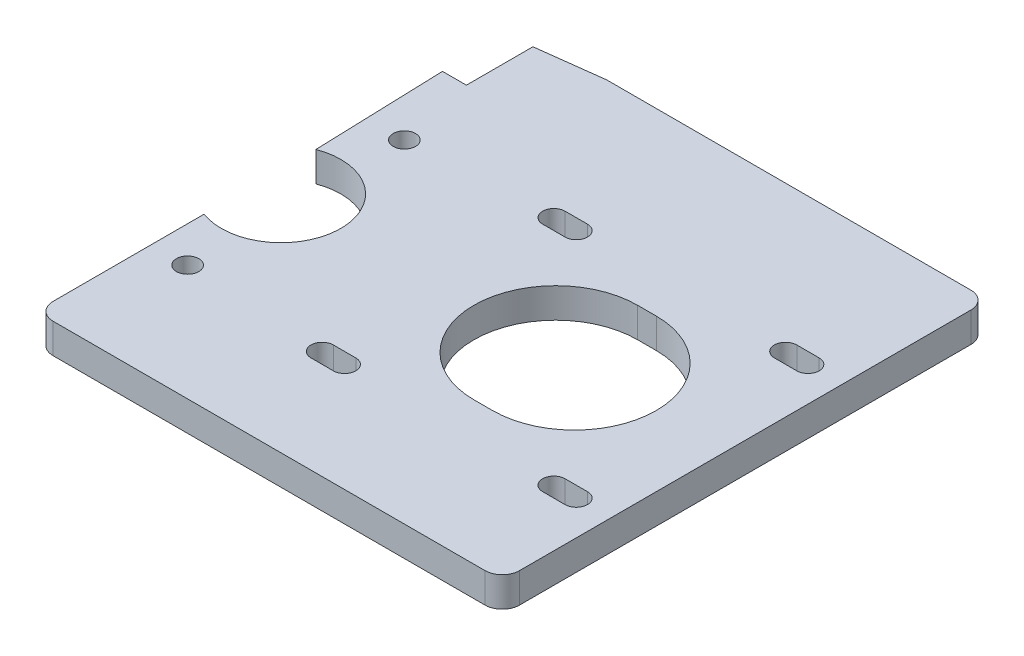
ISO-10303-21;
HEADER;
FILE_DESCRIPTION(('STEP AP214'),'2;1');
FILE_NAME('part.step','',(''),(''),'','','');
FILE_SCHEMA(('AUTOMOTIVE_DESIGN { 1 0 10303 214 1 1 1 1 }'));
ENDSEC;
DATA;
#1=APPLICATION_CONTEXT('core data for automotive mechanical design processes');
#2=APPLICATION_PROTOCOL_DEFINITION('international standard','automotive_design',2000,#1);
#3=PRODUCT_CONTEXT('',#1,'mechanical');
#4=PRODUCT('Part','Part','',(#3));
#5=PRODUCT_RELATED_PRODUCT_CATEGORY('part','',(#4));
#6=PRODUCT_DEFINITION_FORMATION('','',#4);
#7=PRODUCT_DEFINITION_CONTEXT('part definition',#1,'design');
#8=PRODUCT_DEFINITION('design','',#6,#7);
#9=PRODUCT_DEFINITION_SHAPE('','',#8);
#10=(LENGTH_UNIT() NAMED_UNIT(*) SI_UNIT(.MILLI.,.METRE.));
#11=(NAMED_UNIT(*) PLANE_ANGLE_UNIT() SI_UNIT($,.RADIAN.));
#12=(NAMED_UNIT(*) SI_UNIT($,.STERADIAN.) SOLID_ANGLE_UNIT());
#13=UNCERTAINTY_MEASURE_WITH_UNIT(LENGTH_MEASURE(1.E-05),#10,'distance_accuracy_value','');
#14=(GEOMETRIC_REPRESENTATION_CONTEXT(3) GLOBAL_UNCERTAINTY_ASSIGNED_CONTEXT((#13)) GLOBAL_UNIT_ASSIGNED_CONTEXT((#10,
#11,#12)) REPRESENTATION_CONTEXT('',''));
#15=CARTESIAN_POINT('',(0.,0.,0.));
#16=DIRECTION('',(0.,0.,1.));
#17=DIRECTION('',(1.,0.,0.));
#18=AXIS2_PLACEMENT_3D('',#15,#16,#17);
#19=CARTESIAN_POINT('',(0.,-2.,0.));
#20=DIRECTION('',(0.,1.,0.));
#21=DIRECTION('',(0.,0.,1.));
#22=AXIS2_PLACEMENT_3D('',#19,#20,#21);
#23=PLANE('',#22);
#24=CARTESIAN_POINT('',(-26.4,-2.,17.));
#25=DIRECTION('',(0.,1.,0.));
#26=DIRECTION('',(0.,0.,1.));
#27=AXIS2_PLACEMENT_3D('',#24,#25,#26);
#28=CIRCLE('',#27,1.5);
#29=CARTESIAN_POINT('',(-26.4,-2.,18.5));
#30=VERTEX_POINT('',#29);
#31=EDGE_CURVE('E367',#30,#30,#28,.T.);
#32=ORIENTED_EDGE('',*,*,#31,.T.);
#33=EDGE_LOOP('',(#32));
#34=FACE_BOUND('',#33,.T.);
#35=CARTESIAN_POINT('',(-26.4,-2.,-12.));
#36=DIRECTION('',(0.,1.,0.));
#37=DIRECTION('',(0.,0.,1.));
#38=AXIS2_PLACEMENT_3D('',#35,#36,#37);
#39=CIRCLE('',#38,1.5);
#40=CARTESIAN_POINT('',(-26.4,-2.,-10.5));
#41=VERTEX_POINT('',#40);
#42=EDGE_CURVE('E370',#41,#41,#39,.T.);
#43=ORIENTED_EDGE('',*,*,#42,.T.);
#44=EDGE_LOOP('',(#43));
#45=FACE_BOUND('',#44,.T.);
#46=DIRECTION('',(1.,0.,0.));
#47=VECTOR('',#46,1.);
#48=CARTESIAN_POINT('',(-7.4,-2.,-11.5));
#49=LINE('',#48,#47);
#50=CARTESIAN_POINT('',(-7.4,-2.,-11.5));
#51=VERTEX_POINT('',#50);
#52=CARTESIAN_POINT('',(-4.4,-2.,-11.5));
#53=VERTEX_POINT('',#52);
#54=EDGE_CURVE('E238',#51,#53,#49,.T.);
#55=ORIENTED_EDGE('',*,*,#54,.T.);
#56=CARTESIAN_POINT('',(-4.4,-2.,-13.));
#57=DIRECTION('',(0.,1.,0.));
#58=DIRECTION('',(0.,0.,1.));
#59=AXIS2_PLACEMENT_3D('',#56,#57,#58);
#60=CIRCLE('',#59,1.5);
#61=CARTESIAN_POINT('',(-4.4,-2.,-14.5));
#62=VERTEX_POINT('',#61);
#63=EDGE_CURVE('E241',#53,#62,#60,.T.);
#64=ORIENTED_EDGE('',*,*,#63,.T.);
#65=DIRECTION('',(-1.,0.,0.));
#66=VECTOR('',#65,1.);
#67=CARTESIAN_POINT('',(-4.4,-2.,-14.5));
#68=LINE('',#67,#66);
#69=CARTESIAN_POINT('',(-7.4,-2.,-14.5));
#70=VERTEX_POINT('',#69);
#71=EDGE_CURVE('E235',#62,#70,#68,.T.);
#72=ORIENTED_EDGE('',*,*,#71,.T.);
#73=CARTESIAN_POINT('',(-7.4,-2.,-13.));
#74=DIRECTION('',(0.,1.,0.));
#75=DIRECTION('',(0.,0.,1.));
#76=AXIS2_PLACEMENT_3D('',#73,#74,#75);
#77=CIRCLE('',#76,1.5);
#78=EDGE_CURVE('E374',#70,#51,#77,.T.);
#79=ORIENTED_EDGE('',*,*,#78,.T.);
#80=EDGE_LOOP('',(#55,#64,#72,#79));
#81=FACE_BOUND('',#80,.T.);
#82=CARTESIAN_POINT('',(-7.4,-2.,18.));
#83=DIRECTION('',(0.,1.,0.));
#84=DIRECTION('',(0.,0.,1.));
#85=AXIS2_PLACEMENT_3D('',#82,#83,#84);
#86=CIRCLE('',#85,1.5);
#87=CARTESIAN_POINT('',(-7.4,-2.,16.5));
#88=VERTEX_POINT('',#87);
#89=CARTESIAN_POINT('',(-7.4,-2.,19.5));
#90=VERTEX_POINT('',#89);
#91=EDGE_CURVE('E244',#88,#90,#86,.T.);
#92=ORIENTED_EDGE('',*,*,#91,.T.);
#93=DIRECTION('',(1.,0.,0.));
#94=VECTOR('',#93,1.);
#95=CARTESIAN_POINT('',(-7.4,-2.,19.5));
#96=LINE('',#95,#94);
#97=CARTESIAN_POINT('',(-4.4,-2.,19.5));
#98=VERTEX_POINT('',#97);
#99=EDGE_CURVE('E242',#90,#98,#96,.T.);
#100=ORIENTED_EDGE('',*,*,#99,.T.);
#101=CARTESIAN_POINT('',(-4.4,-2.,18.));
#102=DIRECTION('',(0.,1.,0.));
#103=DIRECTION('',(0.,0.,1.));
#104=AXIS2_PLACEMENT_3D('',#101,#102,#103);
#105=CIRCLE('',#104,1.5);
#106=CARTESIAN_POINT('',(-4.4,-2.,16.5));
#107=VERTEX_POINT('',#106);
#108=EDGE_CURVE('E378',#98,#107,#105,.T.);
#109=ORIENTED_EDGE('',*,*,#108,.T.);
#110=DIRECTION('',(-1.,0.,0.));
#111=VECTOR('',#110,1.);
#112=CARTESIAN_POINT('',(-4.4,-2.,16.5));
#113=LINE('',#112,#111);
#114=EDGE_CURVE('E246',#107,#88,#113,.T.);
#115=ORIENTED_EDGE('',*,*,#114,.T.);
#116=EDGE_LOOP('',(#92,#100,#109,#115));
#117=FACE_BOUND('',#116,.T.);
#118=CARTESIAN_POINT('',(23.6,-2.,18.));
#119=DIRECTION('',(0.,1.,0.));
#120=DIRECTION('',(0.,0.,1.));
#121=AXIS2_PLACEMENT_3D('',#118,#119,#120);
#122=CIRCLE('',#121,1.5);
#123=CARTESIAN_POINT('',(23.6,-2.,16.5));
#124=VERTEX_POINT('',#123);
#125=CARTESIAN_POINT('',(23.6,-2.,19.5));
#126=VERTEX_POINT('',#125);
#127=EDGE_CURVE('E252',#124,#126,#122,.T.);
#128=ORIENTED_EDGE('',*,*,#127,.T.);
#129=DIRECTION('',(1.,0.,0.));
#130=VECTOR('',#129,1.);
#131=CARTESIAN_POINT('',(23.6,-2.,19.5));
#132=LINE('',#131,#130);
#133=CARTESIAN_POINT('',(26.6,-2.,19.5));
#134=VERTEX_POINT('',#133);
#135=EDGE_CURVE('E250',#126,#134,#132,.T.);
#136=ORIENTED_EDGE('',*,*,#135,.T.);
#137=CARTESIAN_POINT('',(26.6,-2.,18.));
#138=DIRECTION('',(0.,1.,0.));
#139=DIRECTION('',(0.,0.,1.));
#140=AXIS2_PLACEMENT_3D('',#137,#138,#139);
#141=CIRCLE('',#140,1.5);
#142=CARTESIAN_POINT('',(26.6,-2.,16.5));
#143=VERTEX_POINT('',#142);
#144=EDGE_CURVE('E382',#134,#143,#141,.T.);
#145=ORIENTED_EDGE('',*,*,#144,.T.);
#146=DIRECTION('',(-1.,0.,0.));
#147=VECTOR('',#146,1.);
#148=CARTESIAN_POINT('',(26.6,-2.,16.5));
#149=LINE('',#148,#147);
#150=EDGE_CURVE('E254',#143,#124,#149,.T.);
#151=ORIENTED_EDGE('',*,*,#150,.T.);
#152=EDGE_LOOP('',(#128,#136,#145,#151));
#153=FACE_BOUND('',#152,.T.);
#154=CARTESIAN_POINT('',(23.6,-2.,-13.));
#155=DIRECTION('',(0.,1.,0.));
#156=DIRECTION('',(0.,0.,1.));
#157=AXIS2_PLACEMENT_3D('',#154,#155,#156);
#158=CIRCLE('',#157,1.5);
#159=CARTESIAN_POINT('',(23.6,-2.,-14.5));
#160=VERTEX_POINT('',#159);
#161=CARTESIAN_POINT('',(23.6,-2.,-11.5));
#162=VERTEX_POINT('',#161);
#163=EDGE_CURVE('E260',#160,#162,#158,.T.);
#164=ORIENTED_EDGE('',*,*,#163,.T.);
#165=DIRECTION('',(1.,0.,0.));
#166=VECTOR('',#165,1.);
#167=CARTESIAN_POINT('',(23.6,-2.,-11.5));
#168=LINE('',#167,#166);
#169=CARTESIAN_POINT('',(26.6,-2.,-11.5));
#170=VERTEX_POINT('',#169);
#171=EDGE_CURVE('E258',#162,#170,#168,.T.);
#172=ORIENTED_EDGE('',*,*,#171,.T.);
#173=CARTESIAN_POINT('',(26.6,-2.,-13.));
#174=DIRECTION('',(0.,1.,0.));
#175=DIRECTION('',(0.,0.,1.));
#176=AXIS2_PLACEMENT_3D('',#173,#174,#175);
#177=CIRCLE('',#176,1.5);
#178=CARTESIAN_POINT('',(26.6,-2.,-14.5));
#179=VERTEX_POINT('',#178);
#180=EDGE_CURVE('E386',#170,#179,#177,.T.);
#181=ORIENTED_EDGE('',*,*,#180,.T.);
#182=DIRECTION('',(-1.,0.,0.));
#183=VECTOR('',#182,1.);
#184=CARTESIAN_POINT('',(26.6,-2.,-14.5));
#185=LINE('',#184,#183);
#186=EDGE_CURVE('E262',#179,#160,#185,.T.);
#187=ORIENTED_EDGE('',*,*,#186,.T.);
#188=EDGE_LOOP('',(#164,#172,#181,#187));
#189=FACE_BOUND('',#188,.T.);
#190=CARTESIAN_POINT('',(8.35,-2.,2.5));
#191=DIRECTION('',(0.,1.,0.));
#192=DIRECTION('',(0.,0.,1.));
#193=AXIS2_PLACEMENT_3D('',#190,#191,#192);
#194=CIRCLE('',#193,10.95);
#195=CARTESIAN_POINT('',(8.35,-2.,-8.45));
#196=VERTEX_POINT('',#195);
#197=CARTESIAN_POINT('',(8.35,-2.,13.45));
#198=VERTEX_POINT('',#197);
#199=EDGE_CURVE('E268',#196,#198,#194,.T.);
#200=ORIENTED_EDGE('',*,*,#199,.T.);
#201=DIRECTION('',(1.,0.,0.));
#202=VECTOR('',#201,1.);
#203=CARTESIAN_POINT('',(8.35,-2.,13.45));
#204=LINE('',#203,#202);
#205=CARTESIAN_POINT('',(10.85,-2.,13.45));
#206=VERTEX_POINT('',#205);
#207=EDGE_CURVE('E266',#198,#206,#204,.T.);
#208=ORIENTED_EDGE('',*,*,#207,.T.);
#209=CARTESIAN_POINT('',(10.85,-2.,2.5));
#210=DIRECTION('',(0.,1.,0.));
#211=DIRECTION('',(0.,0.,1.));
#212=AXIS2_PLACEMENT_3D('',#209,#210,#211);
#213=CIRCLE('',#212,10.95);
#214=CARTESIAN_POINT('',(10.85,-2.,-8.45));
#215=VERTEX_POINT('',#214);
#216=EDGE_CURVE('E390',#206,#215,#213,.T.);
#217=ORIENTED_EDGE('',*,*,#216,.T.);
#218=DIRECTION('',(-1.,0.,0.));
#219=VECTOR('',#218,1.);
#220=CARTESIAN_POINT('',(10.85,-2.,-8.45));
#221=LINE('',#220,#219);
#222=EDGE_CURVE('E270',#215,#196,#221,.T.);
#223=ORIENTED_EDGE('',*,*,#222,.T.);
#224=EDGE_LOOP('',(#200,#208,#217,#223));
#225=FACE_BOUND('',#224,.T.);
#226=DIRECTION('',(-1.,0.,0.));
#227=VECTOR('',#226,1.);
#228=CARTESIAN_POINT('',(-28.6,-2.,-22.5));
#229=LINE('',#228,#227);
#230=CARTESIAN_POINT('',(-28.6,-2.,-22.5));
#231=VERTEX_POINT('',#230);
#232=CARTESIAN_POINT('',(-31.8,-2.,-22.5));
#233=VERTEX_POINT('',#232);
#234=EDGE_CURVE('E282',#231,#233,#229,.T.);
#235=ORIENTED_EDGE('',*,*,#234,.F.);
#236=DIRECTION('',(0.,0.,1.));
#237=VECTOR('',#236,1.);
#238=CARTESIAN_POINT('',(-28.6,-2.,-31.4));
#239=LINE('',#238,#237);
#240=CARTESIAN_POINT('',(-28.6,-2.,-31.4));
#241=VERTEX_POINT('',#240);
#242=EDGE_CURVE('E288',#241,#231,#239,.T.);
#243=ORIENTED_EDGE('',*,*,#242,.F.);
#244=DIRECTION('',(-0.992277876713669,0.,0.124034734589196));
#245=VECTOR('',#244,1.);
#246=CARTESIAN_POINT('',(-19.8,-2.,-32.5));
#247=LINE('',#246,#245);
#248=CARTESIAN_POINT('',(-19.8,-2.,-32.5));
#249=VERTEX_POINT('',#248);
#250=EDGE_CURVE('E294',#249,#241,#247,.T.);
#251=ORIENTED_EDGE('',*,*,#250,.F.);
#252=DIRECTION('',(-1.,0.,0.));
#253=VECTOR('',#252,1.);
#254=CARTESIAN_POINT('',(28.9,-2.,-32.5));
#255=LINE('',#254,#253);
#256=CARTESIAN_POINT('',(28.9,-2.,-32.5));
#257=VERTEX_POINT('',#256);
#258=EDGE_CURVE('E300',#257,#249,#255,.T.);
#259=ORIENTED_EDGE('',*,*,#258,.F.);
#260=CARTESIAN_POINT('',(28.9,-2.,-30.2));
#261=DIRECTION('',(0.,1.,0.));
#262=DIRECTION('',(0.,0.,1.));
#263=AXIS2_PLACEMENT_3D('',#260,#261,#262);
#264=CIRCLE('',#263,2.3);
#265=CARTESIAN_POINT('',(31.2,-2.,-30.2));
#266=VERTEX_POINT('',#265);
#267=EDGE_CURVE('E396',#266,#257,#264,.T.);
#268=ORIENTED_EDGE('',*,*,#267,.F.);
#269=DIRECTION('',(0.,0.,-1.));
#270=VECTOR('',#269,1.);
#271=CARTESIAN_POINT('',(31.2,-2.,30.2));
#272=LINE('',#271,#270);
#273=CARTESIAN_POINT('',(31.2,-2.,30.2));
#274=VERTEX_POINT('',#273);
#275=EDGE_CURVE('E306',#274,#266,#272,.T.);
#276=ORIENTED_EDGE('',*,*,#275,.F.);
#277=CARTESIAN_POINT('',(28.9,-2.,30.2));
#278=DIRECTION('',(0.,1.,0.));
#279=DIRECTION('',(0.,0.,1.));
#280=AXIS2_PLACEMENT_3D('',#277,#278,#279);
#281=CIRCLE('',#280,2.3);
#282=CARTESIAN_POINT('',(28.9,-2.,32.5));
#283=VERTEX_POINT('',#282);
#284=EDGE_CURVE('E221',#283,#274,#281,.T.);
#285=ORIENTED_EDGE('',*,*,#284,.F.);
#286=DIRECTION('',(1.,0.,0.));
#287=VECTOR('',#286,1.);
#288=CARTESIAN_POINT('',(-28.9,-2.,32.5));
#289=LINE('',#288,#287);
#290=CARTESIAN_POINT('',(-28.9,-2.,32.5));
#291=VERTEX_POINT('',#290);
#292=EDGE_CURVE('E218',#291,#283,#289,.T.);
#293=ORIENTED_EDGE('',*,*,#292,.F.);
#294=CARTESIAN_POINT('',(-28.9,-2.,30.2));
#295=DIRECTION('',(0.,1.,0.));
#296=DIRECTION('',(0.,0.,1.));
#297=AXIS2_PLACEMENT_3D('',#294,#295,#296);
#298=CIRCLE('',#297,2.3);
#299=CARTESIAN_POINT('',(-31.2,-2.,30.2));
#300=VERTEX_POINT('',#299);
#301=EDGE_CURVE('E20',#300,#291,#298,.T.);
#302=ORIENTED_EDGE('',*,*,#301,.F.);
#303=DIRECTION('',(0.,0.,1.));
#304=VECTOR('',#303,1.);
#305=CARTESIAN_POINT('',(-31.2,-2.,-4.4));
#306=LINE('',#305,#304);
#307=CARTESIAN_POINT('',(-31.2,-2.,9.99399759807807));
#308=VERTEX_POINT('',#307);
#309=EDGE_CURVE('E204',#308,#300,#306,.T.);
#310=ORIENTED_EDGE('',*,*,#309,.F.);
#311=CARTESIAN_POINT('',(-28.4,-2.,2.5));
#312=DIRECTION('',(0.,1.,0.));
#313=DIRECTION('',(0.,0.,1.));
#314=AXIS2_PLACEMENT_3D('',#311,#312,#313);
#315=CIRCLE('',#314,8.);
#316=CARTESIAN_POINT('',(-31.2194486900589,-2.,-4.98670215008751));
#317=VERTEX_POINT('',#316);
#318=EDGE_CURVE('E394',#308,#317,#315,.T.);
#319=ORIENTED_EDGE('',*,*,#318,.T.);
#320=DIRECTION('',(0.0331309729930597,0.,0.999451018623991));
#321=VECTOR('',#320,1.);
#322=CARTESIAN_POINT('',(-31.8,-2.,-22.5));
#323=LINE('',#322,#321);
#324=EDGE_CURVE('E274',#233,#317,#323,.T.);
#325=ORIENTED_EDGE('',*,*,#324,.F.);
#326=EDGE_LOOP('',(#235,#243,#251,#259,#268,#276,#285,#293,#302,#310,#319,#325));
#327=FACE_BOUND('',#326,.T.);
#328=ADVANCED_FACE('F17',(#34,#45,#81,#117,#153,#189,#225,#327),#23,.F.);
#329=CARTESIAN_POINT('',(-31.2,-2.,-4.4));
#330=DIRECTION('',(-1.,0.,0.));
#331=DIRECTION('',(0.,0.,1.));
#332=AXIS2_PLACEMENT_3D('',#329,#330,#331);
#333=PLANE('',#332);
#334=DIRECTION('',(0.,0.,1.));
#335=VECTOR('',#334,1.);
#336=CARTESIAN_POINT('',(-31.2,2.,0.));
#337=LINE('',#336,#335);
#338=CARTESIAN_POINT('',(-31.2,2.,9.99399759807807));
#339=VERTEX_POINT('',#338);
#340=CARTESIAN_POINT('',(-31.2,2.,30.2));
#341=VERTEX_POINT('',#340);
#342=EDGE_CURVE('E366',#339,#341,#337,.T.);
#343=ORIENTED_EDGE('',*,*,#342,.F.);
#344=DIRECTION('',(0.,1.,0.));
#345=VECTOR('',#344,1.);
#346=CARTESIAN_POINT('',(-31.2,2.,9.99399759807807));
#347=LINE('',#346,#345);
#348=EDGE_CURVE('E277',#339,#308,#347,.F.);
#349=ORIENTED_EDGE('',*,*,#348,.T.);
#350=ORIENTED_EDGE('',*,*,#309,.T.);
#351=DIRECTION('',(0.,1.,0.));
#352=VECTOR('',#351,1.);
#353=CARTESIAN_POINT('',(-31.2,-2.,30.2));
#354=LINE('',#353,#352);
#355=EDGE_CURVE('E215',#341,#300,#354,.F.);
#356=ORIENTED_EDGE('',*,*,#355,.F.);
#357=EDGE_LOOP('',(#343,#349,#350,#356));
#358=FACE_BOUND('',#357,.T.);
#359=ADVANCED_FACE('F560',(#358),#333,.T.);
#360=CARTESIAN_POINT('',(-28.9,-2.,30.2));
#361=DIRECTION('',(0.,1.,0.));
#362=DIRECTION('',(0.,0.,1.));
#363=AXIS2_PLACEMENT_3D('',#360,#361,#362);
#364=CYLINDRICAL_SURFACE('',#363,2.3);
#365=ORIENTED_EDGE('',*,*,#355,.T.);
#366=ORIENTED_EDGE('',*,*,#301,.T.);
#367=DIRECTION('',(0.,1.,0.));
#368=VECTOR('',#367,1.);
#369=CARTESIAN_POINT('',(-28.9,-2.,32.5));
#370=LINE('',#369,#368);
#371=CARTESIAN_POINT('',(-28.9,2.,32.5));
#372=VERTEX_POINT('',#371);
#373=EDGE_CURVE('E213',#372,#291,#370,.F.);
#374=ORIENTED_EDGE('',*,*,#373,.F.);
#375=CARTESIAN_POINT('',(-28.9,2.,30.2));
#376=DIRECTION('',(0.,1.,0.));
#377=DIRECTION('',(0.,0.,1.));
#378=AXIS2_PLACEMENT_3D('',#375,#376,#377);
#379=CIRCLE('',#378,2.3);
#380=EDGE_CURVE('E364',#341,#372,#379,.T.);
#381=ORIENTED_EDGE('',*,*,#380,.F.);
#382=EDGE_LOOP('',(#365,#366,#374,#381));
#383=FACE_BOUND('',#382,.T.);
#384=ADVANCED_FACE('F210',(#383),#364,.T.);
#385=CARTESIAN_POINT('',(-28.9,-2.,32.5));
#386=DIRECTION('',(0.,0.,1.));
#387=DIRECTION('',(1.,0.,0.));
#388=AXIS2_PLACEMENT_3D('',#385,#386,#387);
#389=PLANE('',#388);
#390=ORIENTED_EDGE('',*,*,#373,.T.);
#391=ORIENTED_EDGE('',*,*,#292,.T.);
#392=DIRECTION('',(0.,1.,0.));
#393=VECTOR('',#392,1.);
#394=CARTESIAN_POINT('',(28.9,-2.,32.5));
#395=LINE('',#394,#393);
#396=CARTESIAN_POINT('',(28.9,2.,32.5));
#397=VERTEX_POINT('',#396);
#398=EDGE_CURVE('E224',#397,#283,#395,.F.);
#399=ORIENTED_EDGE('',*,*,#398,.F.);
#400=DIRECTION('',(1.,0.,0.));
#401=VECTOR('',#400,1.);
#402=CARTESIAN_POINT('',(0.,2.,32.5));
#403=LINE('',#402,#401);
#404=EDGE_CURVE('E228',#372,#397,#403,.T.);
#405=ORIENTED_EDGE('',*,*,#404,.F.);
#406=EDGE_LOOP('',(#390,#391,#399,#405));
#407=FACE_BOUND('',#406,.T.);
#408=ADVANCED_FACE('F226',(#407),#389,.T.);
#409=CARTESIAN_POINT('',(28.9,-2.,30.2));
#410=DIRECTION('',(0.,1.,0.));
#411=DIRECTION('',(0.,0.,1.));
#412=AXIS2_PLACEMENT_3D('',#409,#410,#411);
#413=CYLINDRICAL_SURFACE('',#412,2.3);
#414=ORIENTED_EDGE('',*,*,#398,.T.);
#415=ORIENTED_EDGE('',*,*,#284,.T.);
#416=DIRECTION('',(0.,1.,0.));
#417=VECTOR('',#416,1.);
#418=CARTESIAN_POINT('',(31.2,-2.,30.2));
#419=LINE('',#418,#417);
#420=CARTESIAN_POINT('',(31.2,2.,30.2));
#421=VERTEX_POINT('',#420);
#422=EDGE_CURVE('E308',#421,#274,#419,.F.);
#423=ORIENTED_EDGE('',*,*,#422,.F.);
#424=CARTESIAN_POINT('',(28.9,2.,30.2));
#425=DIRECTION('',(0.,1.,0.));
#426=DIRECTION('',(0.,0.,1.));
#427=AXIS2_PLACEMENT_3D('',#424,#425,#426);
#428=CIRCLE('',#427,2.3);
#429=EDGE_CURVE('E361',#397,#421,#428,.T.);
#430=ORIENTED_EDGE('',*,*,#429,.F.);
#431=EDGE_LOOP('',(#414,#415,#423,#430));
#432=FACE_BOUND('',#431,.T.);
#433=ADVANCED_FACE('F400',(#432),#413,.T.);
#434=CARTESIAN_POINT('',(31.2,-2.,30.2));
#435=DIRECTION('',(1.,0.,0.));
#436=DIRECTION('',(0.,0.,-1.));
#437=AXIS2_PLACEMENT_3D('',#434,#435,#436);
#438=PLANE('',#437);
#439=ORIENTED_EDGE('',*,*,#422,.T.);
#440=ORIENTED_EDGE('',*,*,#275,.T.);
#441=DIRECTION('',(0.,1.,0.));
#442=VECTOR('',#441,1.);
#443=CARTESIAN_POINT('',(31.2,-2.,-30.2));
#444=LINE('',#443,#442);
#445=CARTESIAN_POINT('',(31.2,2.,-30.2));
#446=VERTEX_POINT('',#445);
#447=EDGE_CURVE('E307',#446,#266,#444,.F.);
#448=ORIENTED_EDGE('',*,*,#447,.F.);
#449=DIRECTION('',(0.,0.,1.));
#450=VECTOR('',#449,1.);
#451=CARTESIAN_POINT('',(31.2,2.,0.));
#452=LINE('',#451,#450);
#453=EDGE_CURVE('E360',#421,#446,#452,.F.);
#454=ORIENTED_EDGE('',*,*,#453,.F.);
#455=EDGE_LOOP('',(#439,#440,#448,#454));
#456=FACE_BOUND('',#455,.T.);
#457=ADVANCED_FACE('F479',(#456),#438,.T.);
#458=CARTESIAN_POINT('',(28.9,-2.,-30.2));
#459=DIRECTION('',(0.,1.,0.));
#460=DIRECTION('',(0.,0.,1.));
#461=AXIS2_PLACEMENT_3D('',#458,#459,#460);
#462=CYLINDRICAL_SURFACE('',#461,2.3);
#463=ORIENTED_EDGE('',*,*,#447,.T.);
#464=ORIENTED_EDGE('',*,*,#267,.T.);
#465=DIRECTION('',(0.,1.,0.));
#466=VECTOR('',#465,1.);
#467=CARTESIAN_POINT('',(28.9,-2.,-32.5));
#468=LINE('',#467,#466);
#469=CARTESIAN_POINT('',(28.9,2.,-32.5));
#470=VERTEX_POINT('',#469);
#471=EDGE_CURVE('E303',#470,#257,#468,.F.);
#472=ORIENTED_EDGE('',*,*,#471,.F.);
#473=CARTESIAN_POINT('',(28.9,2.,-30.2));
#474=DIRECTION('',(0.,1.,0.));
#475=DIRECTION('',(0.,0.,1.));
#476=AXIS2_PLACEMENT_3D('',#473,#474,#475);
#477=CIRCLE('',#476,2.3);
#478=EDGE_CURVE('E356',#446,#470,#477,.T.);
#479=ORIENTED_EDGE('',*,*,#478,.F.);
#480=EDGE_LOOP('',(#463,#464,#472,#479));
#481=FACE_BOUND('',#480,.T.);
#482=ADVANCED_FACE('F475',(#481),#462,.T.);
#483=CARTESIAN_POINT('',(28.9,-2.,-32.5));
#484=DIRECTION('',(0.,0.,-1.));
#485=DIRECTION('',(-1.,0.,0.));
#486=AXIS2_PLACEMENT_3D('',#483,#484,#485);
#487=PLANE('',#486);
#488=ORIENTED_EDGE('',*,*,#471,.T.);
#489=ORIENTED_EDGE('',*,*,#258,.T.);
#490=DIRECTION('',(0.,1.,0.));
#491=VECTOR('',#490,1.);
#492=CARTESIAN_POINT('',(-19.8,-2.,-32.5));
#493=LINE('',#492,#491);
#494=CARTESIAN_POINT('',(-19.8,2.,-32.5));
#495=VERTEX_POINT('',#494);
#496=EDGE_CURVE('E297',#495,#249,#493,.F.);
#497=ORIENTED_EDGE('',*,*,#496,.F.);
#498=DIRECTION('',(1.,0.,0.));
#499=VECTOR('',#498,1.);
#500=CARTESIAN_POINT('',(0.,2.,-32.5));
#501=LINE('',#500,#499);
#502=EDGE_CURVE('E359',#470,#495,#501,.F.);
#503=ORIENTED_EDGE('',*,*,#502,.F.);
#504=EDGE_LOOP('',(#488,#489,#497,#503));
#505=FACE_BOUND('',#504,.T.);
#506=ADVANCED_FACE('F485',(#505),#487,.T.);
#507=CARTESIAN_POINT('',(-19.8,-2.,-32.5));
#508=DIRECTION('',(-0.124034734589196,0.,-0.992277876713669));
#509=DIRECTION('',(-0.992277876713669,0.,0.124034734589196));
#510=AXIS2_PLACEMENT_3D('',#507,#508,#509);
#511=PLANE('',#510);
#512=ORIENTED_EDGE('',*,*,#496,.T.);
#513=ORIENTED_EDGE('',*,*,#250,.T.);
#514=DIRECTION('',(0.,1.,0.));
#515=VECTOR('',#514,1.);
#516=CARTESIAN_POINT('',(-28.6,-2.,-31.4));
#517=LINE('',#516,#515);
#518=CARTESIAN_POINT('',(-28.6,2.,-31.4));
#519=VERTEX_POINT('',#518);
#520=EDGE_CURVE('E291',#519,#241,#517,.F.);
#521=ORIENTED_EDGE('',*,*,#520,.F.);
#522=DIRECTION('',(-0.992277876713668,0.,0.124034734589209));
#523=VECTOR('',#522,1.);
#524=CARTESIAN_POINT('',(-19.8,2.,-32.5));
#525=LINE('',#524,#523);
#526=EDGE_CURVE('E455',#495,#519,#525,.T.);
#527=ORIENTED_EDGE('',*,*,#526,.F.);
#528=EDGE_LOOP('',(#512,#513,#521,#527));
#529=FACE_BOUND('',#528,.T.);
#530=ADVANCED_FACE('F620',(#529),#511,.T.);
#531=CARTESIAN_POINT('',(-28.6,-2.,-31.4));
#532=DIRECTION('',(-1.,0.,0.));
#533=DIRECTION('',(0.,0.,1.));
#534=AXIS2_PLACEMENT_3D('',#531,#532,#533);
#535=PLANE('',#534);
#536=ORIENTED_EDGE('',*,*,#520,.T.);
#537=ORIENTED_EDGE('',*,*,#242,.T.);
#538=DIRECTION('',(0.,1.,0.));
#539=VECTOR('',#538,1.);
#540=CARTESIAN_POINT('',(-28.6,-2.,-22.5));
#541=LINE('',#540,#539);
#542=CARTESIAN_POINT('',(-28.6,2.,-22.5));
#543=VERTEX_POINT('',#542);
#544=EDGE_CURVE('E285',#543,#231,#541,.F.);
#545=ORIENTED_EDGE('',*,*,#544,.F.);
#546=DIRECTION('',(0.,0.,1.));
#547=VECTOR('',#546,1.);
#548=CARTESIAN_POINT('',(-28.6,2.,0.));
#549=LINE('',#548,#547);
#550=EDGE_CURVE('E446',#519,#543,#549,.T.);
#551=ORIENTED_EDGE('',*,*,#550,.F.);
#552=EDGE_LOOP('',(#536,#537,#545,#551));
#553=FACE_BOUND('',#552,.T.);
#554=ADVANCED_FACE('F616',(#553),#535,.T.);
#555=CARTESIAN_POINT('',(-28.6,-2.,-22.5));
#556=DIRECTION('',(0.,0.,-1.));
#557=DIRECTION('',(-1.,0.,0.));
#558=AXIS2_PLACEMENT_3D('',#555,#556,#557);
#559=PLANE('',#558);
#560=ORIENTED_EDGE('',*,*,#544,.T.);
#561=ORIENTED_EDGE('',*,*,#234,.T.);
#562=DIRECTION('',(0.,1.,0.));
#563=VECTOR('',#562,1.);
#564=CARTESIAN_POINT('',(-31.8,-2.,-22.5));
#565=LINE('',#564,#563);
#566=CARTESIAN_POINT('',(-31.8,2.,-22.5));
#567=VERTEX_POINT('',#566);
#568=EDGE_CURVE('E278',#567,#233,#565,.F.);
#569=ORIENTED_EDGE('',*,*,#568,.F.);
#570=DIRECTION('',(1.,0.,0.));
#571=VECTOR('',#570,1.);
#572=CARTESIAN_POINT('',(0.,2.,-22.5));
#573=LINE('',#572,#571);
#574=EDGE_CURVE('E443',#543,#567,#573,.F.);
#575=ORIENTED_EDGE('',*,*,#574,.F.);
#576=EDGE_LOOP('',(#560,#561,#569,#575));
#577=FACE_BOUND('',#576,.T.);
#578=ADVANCED_FACE('F612',(#577),#559,.T.);
#579=CARTESIAN_POINT('',(-31.8,-2.,-22.5));
#580=DIRECTION('',(-0.999451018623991,0.,0.0331309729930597));
#581=DIRECTION('',(0.0331309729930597,0.,0.999451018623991));
#582=AXIS2_PLACEMENT_3D('',#579,#580,#581);
#583=PLANE('',#582);
#584=ORIENTED_EDGE('',*,*,#568,.T.);
#585=ORIENTED_EDGE('',*,*,#324,.T.);
#586=DIRECTION('',(0.,1.,0.));
#587=VECTOR('',#586,1.);
#588=CARTESIAN_POINT('',(-31.2194486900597,2.,-4.98670215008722));
#589=LINE('',#588,#587);
#590=CARTESIAN_POINT('',(-31.2194486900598,2.,-4.98670215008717));
#591=VERTEX_POINT('',#590);
#592=EDGE_CURVE('E269',#317,#591,#589,.T.);
#593=ORIENTED_EDGE('',*,*,#592,.T.);
#594=DIRECTION('',(0.0331309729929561,0.,0.999451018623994));
#595=VECTOR('',#594,1.);
#596=CARTESIAN_POINT('',(-31.8,2.,-22.5));
#597=LINE('',#596,#595);
#598=EDGE_CURVE('E355',#567,#591,#597,.T.);
#599=ORIENTED_EDGE('',*,*,#598,.F.);
#600=EDGE_LOOP('',(#584,#585,#593,#599));
#601=FACE_BOUND('',#600,.T.);
#602=ADVANCED_FACE('F608',(#601),#583,.T.);
#603=CARTESIAN_POINT('',(-28.4,2.,2.5));
#604=DIRECTION('',(0.,1.,0.));
#605=DIRECTION('',(0.,0.,1.));
#606=AXIS2_PLACEMENT_3D('',#603,#604,#605);
#607=CYLINDRICAL_SURFACE('',#606,8.);
#608=ORIENTED_EDGE('',*,*,#318,.F.);
#609=ORIENTED_EDGE('',*,*,#348,.F.);
#610=CARTESIAN_POINT('',(-28.4,2.,2.5));
#611=DIRECTION('',(0.,1.,0.));
#612=DIRECTION('',(0.,0.,1.));
#613=AXIS2_PLACEMENT_3D('',#610,#611,#612);
#614=CIRCLE('',#613,8.);
#615=EDGE_CURVE('E352',#591,#339,#614,.F.);
#616=ORIENTED_EDGE('',*,*,#615,.F.);
#617=ORIENTED_EDGE('',*,*,#592,.F.);
#618=EDGE_LOOP('',(#608,#609,#616,#617));
#619=FACE_BOUND('',#618,.T.);
#620=ADVANCED_FACE('F605',(#619),#607,.F.);
#621=CARTESIAN_POINT('',(8.35,2.,13.45));
#622=DIRECTION('',(0.,0.,1.));
#623=DIRECTION('',(1.,0.,0.));
#624=AXIS2_PLACEMENT_3D('',#621,#622,#623);
#625=PLANE('',#624);
#626=DIRECTION('',(1.,0.,0.));
#627=VECTOR('',#626,1.);
#628=CARTESIAN_POINT('',(0.,2.,13.45));
#629=LINE('',#628,#627);
#630=CARTESIAN_POINT('',(10.85,2.,13.45));
#631=VERTEX_POINT('',#630);
#632=CARTESIAN_POINT('',(8.35,2.,13.45));
#633=VERTEX_POINT('',#632);
#634=EDGE_CURVE('E351',#631,#633,#629,.F.);
#635=ORIENTED_EDGE('',*,*,#634,.F.);
#636=DIRECTION('',(0.,1.,0.));
#637=VECTOR('',#636,1.);
#638=CARTESIAN_POINT('',(10.85,2.,13.45));
#639=LINE('',#638,#637);
#640=EDGE_CURVE('E261',#631,#206,#639,.F.);
#641=ORIENTED_EDGE('',*,*,#640,.T.);
#642=ORIENTED_EDGE('',*,*,#207,.F.);
#643=DIRECTION('',(0.,1.,0.));
#644=VECTOR('',#643,1.);
#645=CARTESIAN_POINT('',(8.35,2.,13.45));
#646=LINE('',#645,#644);
#647=EDGE_CURVE('E273',#198,#633,#646,.T.);
#648=ORIENTED_EDGE('',*,*,#647,.T.);
#649=EDGE_LOOP('',(#635,#641,#642,#648));
#650=FACE_BOUND('',#649,.T.);
#651=ADVANCED_FACE('F579',(#650),#625,.F.);
#652=CARTESIAN_POINT('',(8.35,2.,2.5));
#653=DIRECTION('',(0.,1.,0.));
#654=DIRECTION('',(0.,0.,1.));
#655=AXIS2_PLACEMENT_3D('',#652,#653,#654);
#656=CYLINDRICAL_SURFACE('',#655,10.95);
#657=CARTESIAN_POINT('',(8.35,2.,2.5));
#658=DIRECTION('',(0.,1.,0.));
#659=DIRECTION('',(0.,0.,1.));
#660=AXIS2_PLACEMENT_3D('',#657,#658,#659);
#661=CIRCLE('',#660,10.95);
#662=CARTESIAN_POINT('',(8.35,2.,-8.45));
#663=VERTEX_POINT('',#662);
#664=EDGE_CURVE('E348',#633,#663,#661,.F.);
#665=ORIENTED_EDGE('',*,*,#664,.F.);
#666=ORIENTED_EDGE('',*,*,#647,.F.);
#667=ORIENTED_EDGE('',*,*,#199,.F.);
#668=DIRECTION('',(0.,1.,0.));
#669=VECTOR('',#668,1.);
#670=CARTESIAN_POINT('',(8.35,2.,-8.45));
#671=LINE('',#670,#669);
#672=EDGE_CURVE('E272',#196,#663,#671,.T.);
#673=ORIENTED_EDGE('',*,*,#672,.T.);
#674=EDGE_LOOP('',(#665,#666,#667,#673));
#675=FACE_BOUND('',#674,.T.);
#676=ADVANCED_FACE('F583',(#675),#656,.F.);
#677=CARTESIAN_POINT('',(10.85,2.,-8.45));
#678=DIRECTION('',(0.,0.,-1.));
#679=DIRECTION('',(-1.,0.,0.));
#680=AXIS2_PLACEMENT_3D('',#677,#678,#679);
#681=PLANE('',#680);
#682=DIRECTION('',(1.,0.,0.));
#683=VECTOR('',#682,1.);
#684=CARTESIAN_POINT('',(0.,2.,-8.45));
#685=LINE('',#684,#683);
#686=CARTESIAN_POINT('',(10.85,2.,-8.45));
#687=VERTEX_POINT('',#686);
#688=EDGE_CURVE('E347',#663,#687,#685,.T.);
#689=ORIENTED_EDGE('',*,*,#688,.F.);
#690=ORIENTED_EDGE('',*,*,#672,.F.);
#691=ORIENTED_EDGE('',*,*,#222,.F.);
#692=DIRECTION('',(0.,1.,0.));
#693=VECTOR('',#692,1.);
#694=CARTESIAN_POINT('',(10.85,2.,-8.45));
#695=LINE('',#694,#693);
#696=EDGE_CURVE('E392',#215,#687,#695,.T.);
#697=ORIENTED_EDGE('',*,*,#696,.T.);
#698=EDGE_LOOP('',(#689,#690,#691,#697));
#699=FACE_BOUND('',#698,.T.);
#700=ADVANCED_FACE('F591',(#699),#681,.F.);
#701=CARTESIAN_POINT('',(10.85,2.,2.5));
#702=DIRECTION('',(0.,1.,0.));
#703=DIRECTION('',(0.,0.,1.));
#704=AXIS2_PLACEMENT_3D('',#701,#702,#703);
#705=CYLINDRICAL_SURFACE('',#704,10.95);
#706=CARTESIAN_POINT('',(10.85,2.,2.5));
#707=DIRECTION('',(0.,1.,0.));
#708=DIRECTION('',(0.,0.,1.));
#709=AXIS2_PLACEMENT_3D('',#706,#707,#708);
#710=CIRCLE('',#709,10.95);
#711=EDGE_CURVE('E344',#687,#631,#710,.F.);
#712=ORIENTED_EDGE('',*,*,#711,.F.);
#713=ORIENTED_EDGE('',*,*,#696,.F.);
#714=ORIENTED_EDGE('',*,*,#216,.F.);
#715=ORIENTED_EDGE('',*,*,#640,.F.);
#716=EDGE_LOOP('',(#712,#713,#714,#715));
#717=FACE_BOUND('',#716,.T.);
#718=ADVANCED_FACE('F588',(#717),#705,.F.);
#719=CARTESIAN_POINT('',(23.6,2.,-11.5));
#720=DIRECTION('',(0.,0.,1.));
#721=DIRECTION('',(1.,0.,0.));
#722=AXIS2_PLACEMENT_3D('',#719,#720,#721);
#723=PLANE('',#722);
#724=DIRECTION('',(1.,0.,0.));
#725=VECTOR('',#724,1.);
#726=CARTESIAN_POINT('',(0.,2.,-11.5));
#727=LINE('',#726,#725);
#728=CARTESIAN_POINT('',(26.6,2.,-11.5));
#729=VERTEX_POINT('',#728);
#730=CARTESIAN_POINT('',(23.6,2.,-11.5));
#731=VERTEX_POINT('',#730);
#732=EDGE_CURVE('E343',#729,#731,#727,.F.);
#733=ORIENTED_EDGE('',*,*,#732,.F.);
#734=DIRECTION('',(0.,1.,0.));
#735=VECTOR('',#734,1.);
#736=CARTESIAN_POINT('',(26.6,2.,-11.5));
#737=LINE('',#736,#735);
#738=EDGE_CURVE('E253',#729,#170,#737,.F.);
#739=ORIENTED_EDGE('',*,*,#738,.T.);
#740=ORIENTED_EDGE('',*,*,#171,.F.);
#741=DIRECTION('',(0.,1.,0.));
#742=VECTOR('',#741,1.);
#743=CARTESIAN_POINT('',(23.6,2.,-11.5));
#744=LINE('',#743,#742);
#745=EDGE_CURVE('E265',#162,#731,#744,.T.);
#746=ORIENTED_EDGE('',*,*,#745,.T.);
#747=EDGE_LOOP('',(#733,#739,#740,#746));
#748=FACE_BOUND('',#747,.T.);
#749=ADVANCED_FACE('F598',(#748),#723,.F.);
#750=CARTESIAN_POINT('',(23.6,2.,-13.));
#751=DIRECTION('',(0.,1.,0.));
#752=DIRECTION('',(0.,0.,1.));
#753=AXIS2_PLACEMENT_3D('',#750,#751,#752);
#754=CYLINDRICAL_SURFACE('',#753,1.5);
#755=CARTESIAN_POINT('',(23.6,2.,-13.));
#756=DIRECTION('',(0.,1.,0.));
#757=DIRECTION('',(0.,0.,1.));
#758=AXIS2_PLACEMENT_3D('',#755,#756,#757);
#759=CIRCLE('',#758,1.5);
#760=CARTESIAN_POINT('',(23.6,2.,-14.5));
#761=VERTEX_POINT('',#760);
#762=EDGE_CURVE('E340',#731,#761,#759,.F.);
#763=ORIENTED_EDGE('',*,*,#762,.F.);
#764=ORIENTED_EDGE('',*,*,#745,.F.);
#765=ORIENTED_EDGE('',*,*,#163,.F.);
#766=DIRECTION('',(0.,1.,0.));
#767=VECTOR('',#766,1.);
#768=CARTESIAN_POINT('',(23.6,2.,-14.5));
#769=LINE('',#768,#767);
#770=EDGE_CURVE('E264',#160,#761,#769,.T.);
#771=ORIENTED_EDGE('',*,*,#770,.T.);
#772=EDGE_LOOP('',(#763,#764,#765,#771));
#773=FACE_BOUND('',#772,.T.);
#774=ADVANCED_FACE('F733',(#773),#754,.F.);
#775=CARTESIAN_POINT('',(26.6,2.,-14.5));
#776=DIRECTION('',(0.,0.,-1.));
#777=DIRECTION('',(-1.,0.,0.));
#778=AXIS2_PLACEMENT_3D('',#775,#776,#777);
#779=PLANE('',#778);
#780=DIRECTION('',(1.,0.,0.));
#781=VECTOR('',#780,1.);
#782=CARTESIAN_POINT('',(0.,2.,-14.5));
#783=LINE('',#782,#781);
#784=CARTESIAN_POINT('',(26.6,2.,-14.5));
#785=VERTEX_POINT('',#784);
#786=EDGE_CURVE('E339',#761,#785,#783,.T.);
#787=ORIENTED_EDGE('',*,*,#786,.F.);
#788=ORIENTED_EDGE('',*,*,#770,.F.);
#789=ORIENTED_EDGE('',*,*,#186,.F.);
#790=DIRECTION('',(0.,1.,0.));
#791=VECTOR('',#790,1.);
#792=CARTESIAN_POINT('',(26.6,2.,-14.5));
#793=LINE('',#792,#791);
#794=EDGE_CURVE('E388',#179,#785,#793,.T.);
#795=ORIENTED_EDGE('',*,*,#794,.T.);
#796=EDGE_LOOP('',(#787,#788,#789,#795));
#797=FACE_BOUND('',#796,.T.);
#798=ADVANCED_FACE('F740',(#797),#779,.F.);
#799=CARTESIAN_POINT('',(26.6,2.,-13.));
#800=DIRECTION('',(0.,1.,0.));
#801=DIRECTION('',(0.,0.,1.));
#802=AXIS2_PLACEMENT_3D('',#799,#800,#801);
#803=CYLINDRICAL_SURFACE('',#802,1.5);
#804=CARTESIAN_POINT('',(26.6,2.,-13.));
#805=DIRECTION('',(0.,1.,0.));
#806=DIRECTION('',(0.,0.,1.));
#807=AXIS2_PLACEMENT_3D('',#804,#805,#806);
#808=CIRCLE('',#807,1.5);
#809=EDGE_CURVE('E336',#785,#729,#808,.F.);
#810=ORIENTED_EDGE('',*,*,#809,.F.);
#811=ORIENTED_EDGE('',*,*,#794,.F.);
#812=ORIENTED_EDGE('',*,*,#180,.F.);
#813=ORIENTED_EDGE('',*,*,#738,.F.);
#814=EDGE_LOOP('',(#810,#811,#812,#813));
#815=FACE_BOUND('',#814,.T.);
#816=ADVANCED_FACE('F748',(#815),#803,.F.);
#817=CARTESIAN_POINT('',(23.6,2.,19.5));
#818=DIRECTION('',(0.,0.,1.));
#819=DIRECTION('',(1.,0.,0.));
#820=AXIS2_PLACEMENT_3D('',#817,#818,#819);
#821=PLANE('',#820);
#822=DIRECTION('',(1.,0.,0.));
#823=VECTOR('',#822,1.);
#824=CARTESIAN_POINT('',(0.,2.,19.5));
#825=LINE('',#824,#823);
#826=CARTESIAN_POINT('',(26.6,2.,19.5));
#827=VERTEX_POINT('',#826);
#828=CARTESIAN_POINT('',(23.6,2.,19.5));
#829=VERTEX_POINT('',#828);
#830=EDGE_CURVE('E335',#827,#829,#825,.F.);
#831=ORIENTED_EDGE('',*,*,#830,.F.);
#832=DIRECTION('',(0.,1.,0.));
#833=VECTOR('',#832,1.);
#834=CARTESIAN_POINT('',(26.6,2.,19.5));
#835=LINE('',#834,#833);
#836=EDGE_CURVE('E245',#827,#134,#835,.F.);
#837=ORIENTED_EDGE('',*,*,#836,.T.);
#838=ORIENTED_EDGE('',*,*,#135,.F.);
#839=DIRECTION('',(0.,1.,0.));
#840=VECTOR('',#839,1.);
#841=CARTESIAN_POINT('',(23.6,2.,19.5));
#842=LINE('',#841,#840);
#843=EDGE_CURVE('E257',#126,#829,#842,.T.);
#844=ORIENTED_EDGE('',*,*,#843,.T.);
#845=EDGE_LOOP('',(#831,#837,#838,#844));
#846=FACE_BOUND('',#845,.T.);
#847=ADVANCED_FACE('F756',(#846),#821,.F.);
#848=CARTESIAN_POINT('',(23.6,2.,18.));
#849=DIRECTION('',(0.,1.,0.));
#850=DIRECTION('',(0.,0.,1.));
#851=AXIS2_PLACEMENT_3D('',#848,#849,#850);
#852=CYLINDRICAL_SURFACE('',#851,1.5);
#853=CARTESIAN_POINT('',(23.6,2.,18.));
#854=DIRECTION('',(0.,1.,0.));
#855=DIRECTION('',(0.,0.,1.));
#856=AXIS2_PLACEMENT_3D('',#853,#854,#855);
#857=CIRCLE('',#856,1.5);
#858=CARTESIAN_POINT('',(23.6,2.,16.5));
#859=VERTEX_POINT('',#858);
#860=EDGE_CURVE('E332',#829,#859,#857,.F.);
#861=ORIENTED_EDGE('',*,*,#860,.F.);
#862=ORIENTED_EDGE('',*,*,#843,.F.);
#863=ORIENTED_EDGE('',*,*,#127,.F.);
#864=DIRECTION('',(0.,1.,0.));
#865=VECTOR('',#864,1.);
#866=CARTESIAN_POINT('',(23.6,2.,16.5));
#867=LINE('',#866,#865);
#868=EDGE_CURVE('E256',#124,#859,#867,.T.);
#869=ORIENTED_EDGE('',*,*,#868,.T.);
#870=EDGE_LOOP('',(#861,#862,#863,#869));
#871=FACE_BOUND('',#870,.T.);
#872=ADVANCED_FACE('F764',(#871),#852,.F.);
#873=CARTESIAN_POINT('',(26.6,2.,16.5));
#874=DIRECTION('',(0.,0.,-1.));
#875=DIRECTION('',(-1.,0.,0.));
#876=AXIS2_PLACEMENT_3D('',#873,#874,#875);
#877=PLANE('',#876);
#878=DIRECTION('',(1.,0.,0.));
#879=VECTOR('',#878,1.);
#880=CARTESIAN_POINT('',(0.,2.,16.5));
#881=LINE('',#880,#879);
#882=CARTESIAN_POINT('',(26.6,2.,16.5));
#883=VERTEX_POINT('',#882);
#884=EDGE_CURVE('E331',#859,#883,#881,.T.);
#885=ORIENTED_EDGE('',*,*,#884,.F.);
#886=ORIENTED_EDGE('',*,*,#868,.F.);
#887=ORIENTED_EDGE('',*,*,#150,.F.);
#888=DIRECTION('',(0.,1.,0.));
#889=VECTOR('',#888,1.);
#890=CARTESIAN_POINT('',(26.6,2.,16.5));
#891=LINE('',#890,#889);
#892=EDGE_CURVE('E384',#143,#883,#891,.T.);
#893=ORIENTED_EDGE('',*,*,#892,.T.);
#894=EDGE_LOOP('',(#885,#886,#887,#893));
#895=FACE_BOUND('',#894,.T.);
#896=ADVANCED_FACE('F772',(#895),#877,.F.);
#897=CARTESIAN_POINT('',(26.6,2.,18.));
#898=DIRECTION('',(0.,1.,0.));
#899=DIRECTION('',(0.,0.,1.));
#900=AXIS2_PLACEMENT_3D('',#897,#898,#899);
#901=CYLINDRICAL_SURFACE('',#900,1.5);
#902=CARTESIAN_POINT('',(26.6,2.,18.));
#903=DIRECTION('',(0.,1.,0.));
#904=DIRECTION('',(0.,0.,1.));
#905=AXIS2_PLACEMENT_3D('',#902,#903,#904);
#906=CIRCLE('',#905,1.5);
#907=EDGE_CURVE('E328',#883,#827,#906,.F.);
#908=ORIENTED_EDGE('',*,*,#907,.F.);
#909=ORIENTED_EDGE('',*,*,#892,.F.);
#910=ORIENTED_EDGE('',*,*,#144,.F.);
#911=ORIENTED_EDGE('',*,*,#836,.F.);
#912=EDGE_LOOP('',(#908,#909,#910,#911));
#913=FACE_BOUND('',#912,.T.);
#914=ADVANCED_FACE('F780',(#913),#901,.F.);
#915=CARTESIAN_POINT('',(-7.4,2.,19.5));
#916=DIRECTION('',(0.,0.,1.));
#917=DIRECTION('',(1.,0.,0.));
#918=AXIS2_PLACEMENT_3D('',#915,#916,#917);
#919=PLANE('',#918);
#920=DIRECTION('',(1.,0.,0.));
#921=VECTOR('',#920,1.);
#922=CARTESIAN_POINT('',(0.,2.,19.5));
#923=LINE('',#922,#921);
#924=CARTESIAN_POINT('',(-4.4,2.,19.5));
#925=VERTEX_POINT('',#924);
#926=CARTESIAN_POINT('',(-7.4,2.,19.5));
#927=VERTEX_POINT('',#926);
#928=EDGE_CURVE('E327',#925,#927,#923,.F.);
#929=ORIENTED_EDGE('',*,*,#928,.F.);
#930=DIRECTION('',(0.,1.,0.));
#931=VECTOR('',#930,1.);
#932=CARTESIAN_POINT('',(-4.4,2.,19.5));
#933=LINE('',#932,#931);
#934=EDGE_CURVE('E377',#925,#98,#933,.F.);
#935=ORIENTED_EDGE('',*,*,#934,.T.);
#936=ORIENTED_EDGE('',*,*,#99,.F.);
#937=DIRECTION('',(0.,1.,0.));
#938=VECTOR('',#937,1.);
#939=CARTESIAN_POINT('',(-7.4,2.,19.5));
#940=LINE('',#939,#938);
#941=EDGE_CURVE('E249',#90,#927,#940,.T.);
#942=ORIENTED_EDGE('',*,*,#941,.T.);
#943=EDGE_LOOP('',(#929,#935,#936,#942));
#944=FACE_BOUND('',#943,.T.);
#945=ADVANCED_FACE('F788',(#944),#919,.F.);
#946=CARTESIAN_POINT('',(-7.4,2.,18.));
#947=DIRECTION('',(0.,1.,0.));
#948=DIRECTION('',(0.,0.,1.));
#949=AXIS2_PLACEMENT_3D('',#946,#947,#948);
#950=CYLINDRICAL_SURFACE('',#949,1.5);
#951=CARTESIAN_POINT('',(-7.4,2.,18.));
#952=DIRECTION('',(0.,1.,0.));
#953=DIRECTION('',(0.,0.,1.));
#954=AXIS2_PLACEMENT_3D('',#951,#952,#953);
#955=CIRCLE('',#954,1.5);
#956=CARTESIAN_POINT('',(-7.4,2.,16.5));
#957=VERTEX_POINT('',#956);
#958=EDGE_CURVE('E324',#927,#957,#955,.F.);
#959=ORIENTED_EDGE('',*,*,#958,.F.);
#960=ORIENTED_EDGE('',*,*,#941,.F.);
#961=ORIENTED_EDGE('',*,*,#91,.F.);
#962=DIRECTION('',(0.,1.,0.));
#963=VECTOR('',#962,1.);
#964=CARTESIAN_POINT('',(-7.4,2.,16.5));
#965=LINE('',#964,#963);
#966=EDGE_CURVE('E248',#88,#957,#965,.T.);
#967=ORIENTED_EDGE('',*,*,#966,.T.);
#968=EDGE_LOOP('',(#959,#960,#961,#967));
#969=FACE_BOUND('',#968,.T.);
#970=ADVANCED_FACE('F796',(#969),#950,.F.);
#971=CARTESIAN_POINT('',(-4.4,2.,16.5));
#972=DIRECTION('',(0.,0.,-1.));
#973=DIRECTION('',(-1.,0.,0.));
#974=AXIS2_PLACEMENT_3D('',#971,#972,#973);
#975=PLANE('',#974);
#976=DIRECTION('',(1.,0.,0.));
#977=VECTOR('',#976,1.);
#978=CARTESIAN_POINT('',(0.,2.,16.5));
#979=LINE('',#978,#977);
#980=CARTESIAN_POINT('',(-4.4,2.,16.5));
#981=VERTEX_POINT('',#980);
#982=EDGE_CURVE('E323',#957,#981,#979,.T.);
#983=ORIENTED_EDGE('',*,*,#982,.F.);
#984=ORIENTED_EDGE('',*,*,#966,.F.);
#985=ORIENTED_EDGE('',*,*,#114,.F.);
#986=DIRECTION('',(0.,1.,0.));
#987=VECTOR('',#986,1.);
#988=CARTESIAN_POINT('',(-4.4,2.,16.5));
#989=LINE('',#988,#987);
#990=EDGE_CURVE('E380',#107,#981,#989,.T.);
#991=ORIENTED_EDGE('',*,*,#990,.T.);
#992=EDGE_LOOP('',(#983,#984,#985,#991));
#993=FACE_BOUND('',#992,.T.);
#994=ADVANCED_FACE('F804',(#993),#975,.F.);
#995=CARTESIAN_POINT('',(-4.4,2.,18.));
#996=DIRECTION('',(0.,1.,0.));
#997=DIRECTION('',(0.,0.,1.));
#998=AXIS2_PLACEMENT_3D('',#995,#996,#997);
#999=CYLINDRICAL_SURFACE('',#998,1.5);
#1000=CARTESIAN_POINT('',(-4.4,2.,18.));
#1001=DIRECTION('',(0.,1.,0.));
#1002=DIRECTION('',(0.,0.,1.));
#1003=AXIS2_PLACEMENT_3D('',#1000,#1001,#1002);
#1004=CIRCLE('',#1003,1.5);
#1005=EDGE_CURVE('E320',#981,#925,#1004,.F.);
#1006=ORIENTED_EDGE('',*,*,#1005,.F.);
#1007=ORIENTED_EDGE('',*,*,#990,.F.);
#1008=ORIENTED_EDGE('',*,*,#108,.F.);
#1009=ORIENTED_EDGE('',*,*,#934,.F.);
#1010=EDGE_LOOP('',(#1006,#1007,#1008,#1009));
#1011=FACE_BOUND('',#1010,.T.);
#1012=ADVANCED_FACE('F812',(#1011),#999,.F.);
#1013=CARTESIAN_POINT('',(-4.4,2.,-13.));
#1014=DIRECTION('',(0.,1.,0.));
#1015=DIRECTION('',(0.,0.,1.));
#1016=AXIS2_PLACEMENT_3D('',#1013,#1014,#1015);
#1017=CYLINDRICAL_SURFACE('',#1016,1.5);
#1018=CARTESIAN_POINT('',(-4.4,2.,-13.));
#1019=DIRECTION('',(0.,1.,0.));
#1020=DIRECTION('',(0.,0.,1.));
#1021=AXIS2_PLACEMENT_3D('',#1018,#1019,#1020);
#1022=CIRCLE('',#1021,1.5);
#1023=CARTESIAN_POINT('',(-4.4,2.,-14.5));
#1024=VERTEX_POINT('',#1023);
#1025=CARTESIAN_POINT('',(-4.4,2.,-11.5));
#1026=VERTEX_POINT('',#1025);
#1027=EDGE_CURVE('E317',#1024,#1026,#1022,.F.);
#1028=ORIENTED_EDGE('',*,*,#1027,.F.);
#1029=DIRECTION('',(0.,1.,0.));
#1030=VECTOR('',#1029,1.);
#1031=CARTESIAN_POINT('',(-4.4,2.,-14.5));
#1032=LINE('',#1031,#1030);
#1033=EDGE_CURVE('E373',#1024,#62,#1032,.F.);
#1034=ORIENTED_EDGE('',*,*,#1033,.T.);
#1035=ORIENTED_EDGE('',*,*,#63,.F.);
#1036=DIRECTION('',(0.,1.,0.));
#1037=VECTOR('',#1036,1.);
#1038=CARTESIAN_POINT('',(-4.4,2.,-11.5));
#1039=LINE('',#1038,#1037);
#1040=EDGE_CURVE('E240',#53,#1026,#1039,.T.);
#1041=ORIENTED_EDGE('',*,*,#1040,.T.);
#1042=EDGE_LOOP('',(#1028,#1034,#1035,#1041));
#1043=FACE_BOUND('',#1042,.T.);
#1044=ADVANCED_FACE('F521',(#1043),#1017,.F.);
#1045=CARTESIAN_POINT('',(-7.4,2.,-11.5));
#1046=DIRECTION('',(0.,0.,1.));
#1047=DIRECTION('',(1.,0.,0.));
#1048=AXIS2_PLACEMENT_3D('',#1045,#1046,#1047);
#1049=PLANE('',#1048);
#1050=DIRECTION('',(1.,0.,0.));
#1051=VECTOR('',#1050,1.);
#1052=CARTESIAN_POINT('',(0.,2.,-11.5));
#1053=LINE('',#1052,#1051);
#1054=CARTESIAN_POINT('',(-7.4,2.,-11.5));
#1055=VERTEX_POINT('',#1054);
#1056=EDGE_CURVE('E316',#1026,#1055,#1053,.F.);
#1057=ORIENTED_EDGE('',*,*,#1056,.F.);
#1058=ORIENTED_EDGE('',*,*,#1040,.F.);
#1059=ORIENTED_EDGE('',*,*,#54,.F.);
#1060=DIRECTION('',(0.,1.,0.));
#1061=VECTOR('',#1060,1.);
#1062=CARTESIAN_POINT('',(-7.4,2.,-11.5));
#1063=LINE('',#1062,#1061);
#1064=EDGE_CURVE('E237',#51,#1055,#1063,.T.);
#1065=ORIENTED_EDGE('',*,*,#1064,.T.);
#1066=EDGE_LOOP('',(#1057,#1058,#1059,#1065));
#1067=FACE_BOUND('',#1066,.T.);
#1068=ADVANCED_FACE('F526',(#1067),#1049,.F.);
#1069=CARTESIAN_POINT('',(-7.4,2.,-13.));
#1070=DIRECTION('',(0.,1.,0.));
#1071=DIRECTION('',(0.,0.,1.));
#1072=AXIS2_PLACEMENT_3D('',#1069,#1070,#1071);
#1073=CYLINDRICAL_SURFACE('',#1072,1.5);
#1074=CARTESIAN_POINT('',(-7.4,2.,-13.));
#1075=DIRECTION('',(0.,1.,0.));
#1076=DIRECTION('',(0.,0.,1.));
#1077=AXIS2_PLACEMENT_3D('',#1074,#1075,#1076);
#1078=CIRCLE('',#1077,1.5);
#1079=CARTESIAN_POINT('',(-7.4,2.,-14.5));
#1080=VERTEX_POINT('',#1079);
#1081=EDGE_CURVE('E313',#1055,#1080,#1078,.F.);
#1082=ORIENTED_EDGE('',*,*,#1081,.F.);
#1083=ORIENTED_EDGE('',*,*,#1064,.F.);
#1084=ORIENTED_EDGE('',*,*,#78,.F.);
#1085=DIRECTION('',(0.,1.,0.));
#1086=VECTOR('',#1085,1.);
#1087=CARTESIAN_POINT('',(-7.4,2.,-14.5));
#1088=LINE('',#1087,#1086);
#1089=EDGE_CURVE('E35',#70,#1080,#1088,.T.);
#1090=ORIENTED_EDGE('',*,*,#1089,.T.);
#1091=EDGE_LOOP('',(#1082,#1083,#1084,#1090));
#1092=FACE_BOUND('',#1091,.T.);
#1093=ADVANCED_FACE('F528',(#1092),#1073,.F.);
#1094=CARTESIAN_POINT('',(-4.4,2.,-14.5));
#1095=DIRECTION('',(0.,0.,-1.));
#1096=DIRECTION('',(-1.,0.,0.));
#1097=AXIS2_PLACEMENT_3D('',#1094,#1095,#1096);
#1098=PLANE('',#1097);
#1099=DIRECTION('',(1.,0.,0.));
#1100=VECTOR('',#1099,1.);
#1101=CARTESIAN_POINT('',(0.,2.,-14.5));
#1102=LINE('',#1101,#1100);
#1103=EDGE_CURVE('E312',#1080,#1024,#1102,.T.);
#1104=ORIENTED_EDGE('',*,*,#1103,.F.);
#1105=ORIENTED_EDGE('',*,*,#1089,.F.);
#1106=ORIENTED_EDGE('',*,*,#71,.F.);
#1107=ORIENTED_EDGE('',*,*,#1033,.F.);
#1108=EDGE_LOOP('',(#1104,#1105,#1106,#1107));
#1109=FACE_BOUND('',#1108,.T.);
#1110=ADVANCED_FACE('F517',(#1109),#1098,.F.);
#1111=CARTESIAN_POINT('',(-26.4,2.,-12.));
#1112=DIRECTION('',(0.,1.,0.));
#1113=DIRECTION('',(0.,0.,1.));
#1114=AXIS2_PLACEMENT_3D('',#1111,#1112,#1113);
#1115=CYLINDRICAL_SURFACE('',#1114,1.5);
#1116=CARTESIAN_POINT('',(-26.4,2.,-12.));
#1117=DIRECTION('',(0.,1.,0.));
#1118=DIRECTION('',(0.,0.,1.));
#1119=AXIS2_PLACEMENT_3D('',#1116,#1117,#1118);
#1120=CIRCLE('',#1119,1.5);
#1121=CARTESIAN_POINT('',(-26.4,2.,-10.5));
#1122=VERTEX_POINT('',#1121);
#1123=EDGE_CURVE('E26',#1122,#1122,#1120,.F.);
#1124=ORIENTED_EDGE('',*,*,#1123,.F.);
#1125=EDGE_LOOP('',(#1124));
#1126=FACE_BOUND('',#1125,.T.);
#1127=ORIENTED_EDGE('',*,*,#42,.F.);
#1128=EDGE_LOOP('',(#1127));
#1129=FACE_BOUND('',#1128,.T.);
#1130=ADVANCED_FACE('F536',(#1126,#1129),#1115,.F.);
#1131=CARTESIAN_POINT('',(-26.4,2.,17.));
#1132=DIRECTION('',(0.,1.,0.));
#1133=DIRECTION('',(0.,0.,1.));
#1134=AXIS2_PLACEMENT_3D('',#1131,#1132,#1133);
#1135=CYLINDRICAL_SURFACE('',#1134,1.5);
#1136=CARTESIAN_POINT('',(-26.4,2.,17.));
#1137=DIRECTION('',(0.,1.,0.));
#1138=DIRECTION('',(0.,0.,1.));
#1139=AXIS2_PLACEMENT_3D('',#1136,#1137,#1138);
#1140=CIRCLE('',#1139,1.5);
#1141=CARTESIAN_POINT('',(-26.4,2.,18.5));
#1142=VERTEX_POINT('',#1141);
#1143=EDGE_CURVE('E11',#1142,#1142,#1140,.F.);
#1144=ORIENTED_EDGE('',*,*,#1143,.F.);
#1145=EDGE_LOOP('',(#1144));
#1146=FACE_BOUND('',#1145,.T.);
#1147=ORIENTED_EDGE('',*,*,#31,.F.);
#1148=EDGE_LOOP('',(#1147));
#1149=FACE_BOUND('',#1148,.T.);
#1150=ADVANCED_FACE('F540',(#1146,#1149),#1135,.F.);
#1151=CARTESIAN_POINT('',(0.,2.,0.));
#1152=DIRECTION('',(0.,1.,0.));
#1153=DIRECTION('',(0.,0.,1.));
#1154=AXIS2_PLACEMENT_3D('',#1151,#1152,#1153);
#1155=PLANE('',#1154);
#1156=ORIENTED_EDGE('',*,*,#1143,.T.);
#1157=EDGE_LOOP('',(#1156));
#1158=FACE_BOUND('',#1157,.T.);
#1159=ORIENTED_EDGE('',*,*,#1123,.T.);
#1160=EDGE_LOOP('',(#1159));
#1161=FACE_BOUND('',#1160,.T.);
#1162=ORIENTED_EDGE('',*,*,#1081,.T.);
#1163=ORIENTED_EDGE('',*,*,#1103,.T.);
#1164=ORIENTED_EDGE('',*,*,#1027,.T.);
#1165=ORIENTED_EDGE('',*,*,#1056,.T.);
#1166=EDGE_LOOP('',(#1162,#1163,#1164,#1165));
#1167=FACE_BOUND('',#1166,.T.);
#1168=ORIENTED_EDGE('',*,*,#982,.T.);
#1169=ORIENTED_EDGE('',*,*,#1005,.T.);
#1170=ORIENTED_EDGE('',*,*,#928,.T.);
#1171=ORIENTED_EDGE('',*,*,#958,.T.);
#1172=EDGE_LOOP('',(#1168,#1169,#1170,#1171));
#1173=FACE_BOUND('',#1172,.T.);
#1174=ORIENTED_EDGE('',*,*,#884,.T.);
#1175=ORIENTED_EDGE('',*,*,#907,.T.);
#1176=ORIENTED_EDGE('',*,*,#830,.T.);
#1177=ORIENTED_EDGE('',*,*,#860,.T.);
#1178=EDGE_LOOP('',(#1174,#1175,#1176,#1177));
#1179=FACE_BOUND('',#1178,.T.);
#1180=ORIENTED_EDGE('',*,*,#786,.T.);
#1181=ORIENTED_EDGE('',*,*,#809,.T.);
#1182=ORIENTED_EDGE('',*,*,#732,.T.);
#1183=ORIENTED_EDGE('',*,*,#762,.T.);
#1184=EDGE_LOOP('',(#1180,#1181,#1182,#1183));
#1185=FACE_BOUND('',#1184,.T.);
#1186=ORIENTED_EDGE('',*,*,#688,.T.);
#1187=ORIENTED_EDGE('',*,*,#711,.T.);
#1188=ORIENTED_EDGE('',*,*,#634,.T.);
#1189=ORIENTED_EDGE('',*,*,#664,.T.);
#1190=EDGE_LOOP('',(#1186,#1187,#1188,#1189));
#1191=FACE_BOUND('',#1190,.T.);
#1192=ORIENTED_EDGE('',*,*,#598,.T.);
#1193=ORIENTED_EDGE('',*,*,#615,.T.);
#1194=ORIENTED_EDGE('',*,*,#342,.T.);
#1195=ORIENTED_EDGE('',*,*,#380,.T.);
#1196=ORIENTED_EDGE('',*,*,#404,.T.);
#1197=ORIENTED_EDGE('',*,*,#429,.T.);
#1198=ORIENTED_EDGE('',*,*,#453,.T.);
#1199=ORIENTED_EDGE('',*,*,#478,.T.);
#1200=ORIENTED_EDGE('',*,*,#502,.T.);
#1201=ORIENTED_EDGE('',*,*,#526,.T.);
#1202=ORIENTED_EDGE('',*,*,#550,.T.);
#1203=ORIENTED_EDGE('',*,*,#574,.T.);
#1204=EDGE_LOOP('',(#1192,#1193,#1194,#1195,#1196,#1197,#1198,#1199,#1200,#1201,#1202,#1203));
#1205=FACE_BOUND('',#1204,.T.);
#1206=ADVANCED_FACE('F405',(#1158,#1161,#1167,#1173,#1179,#1185,#1191,#1205),#1155,.T.);
#1207=CLOSED_SHELL('',(#328,#359,#384,#408,#433,#457,#482,#506,#530,#554,#578,#602,#620,#651,
#676,#700,#718,#749,#774,#798,#816,#847,#872,#896,#914,#945,#970,#994,#1012,#1044,#1068,#1093,
#1110,#1130,#1150,#1206));
#1208=MANIFOLD_SOLID_BREP('B1',#1207);
#1209=ADVANCED_BREP_SHAPE_REPRESENTATION('',(#18,#1208),#14);
#1210=SHAPE_DEFINITION_REPRESENTATION(#9,#1209);
ENDSEC;
END-ISO-10303-21;
